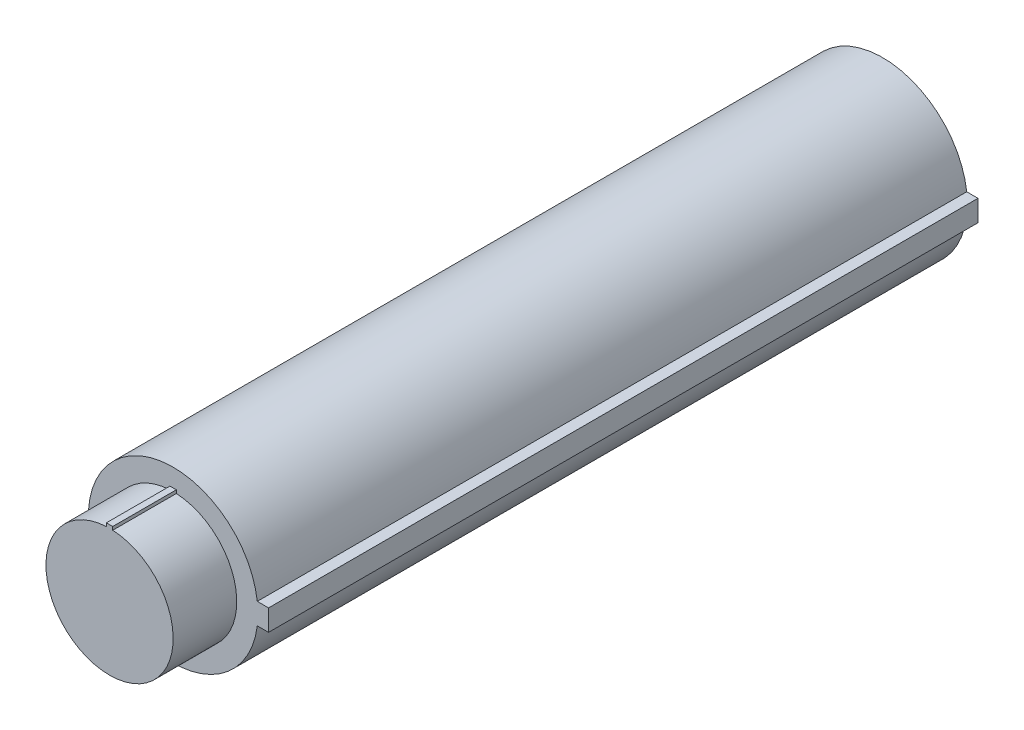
ISO-10303-21;
HEADER;
FILE_DESCRIPTION(('STEP AP214'),'2;1');
FILE_NAME('part.step','',(''),(''),'','','');
FILE_SCHEMA(('AUTOMOTIVE_DESIGN { 1 0 10303 214 1 1 1 1 }'));
ENDSEC;
DATA;
#1=APPLICATION_CONTEXT('core data for automotive mechanical design processes');
#2=APPLICATION_PROTOCOL_DEFINITION('international standard','automotive_design',2000,#1);
#3=PRODUCT_CONTEXT('',#1,'mechanical');
#4=PRODUCT('Part','Part','',(#3));
#5=PRODUCT_RELATED_PRODUCT_CATEGORY('part','',(#4));
#6=PRODUCT_DEFINITION_FORMATION('','',#4);
#7=PRODUCT_DEFINITION_CONTEXT('part definition',#1,'design');
#8=PRODUCT_DEFINITION('design','',#6,#7);
#9=PRODUCT_DEFINITION_SHAPE('','',#8);
#10=(LENGTH_UNIT() NAMED_UNIT(*) SI_UNIT(.MILLI.,.METRE.));
#11=(NAMED_UNIT(*) PLANE_ANGLE_UNIT() SI_UNIT($,.RADIAN.));
#12=(NAMED_UNIT(*) SI_UNIT($,.STERADIAN.) SOLID_ANGLE_UNIT());
#13=UNCERTAINTY_MEASURE_WITH_UNIT(LENGTH_MEASURE(1.E-05),#10,'distance_accuracy_value','');
#14=(GEOMETRIC_REPRESENTATION_CONTEXT(3) GLOBAL_UNCERTAINTY_ASSIGNED_CONTEXT((#13)) GLOBAL_UNIT_ASSIGNED_CONTEXT((#10,
#11,#12)) REPRESENTATION_CONTEXT('',''));
#15=CARTESIAN_POINT('',(0.,0.,0.));
#16=DIRECTION('',(0.,0.,1.));
#17=DIRECTION('',(1.,0.,0.));
#18=AXIS2_PLACEMENT_3D('',#15,#16,#17);
#19=CARTESIAN_POINT('',(0.,0.,0.));
#20=DIRECTION('',(0.,0.,-1.));
#21=DIRECTION('',(-1.,0.,0.));
#22=AXIS2_PLACEMENT_3D('',#19,#20,#21);
#23=PLANE('',#22);
#24=DIRECTION('',(0.,-1.,0.));
#25=VECTOR('',#24,1.);
#26=CARTESIAN_POINT('',(-0.750000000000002,15.75,0.));
#27=LINE('',#26,#25);
#28=CARTESIAN_POINT('',(-0.750000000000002,15.75,0.));
#29=VERTEX_POINT('',#28);
#30=CARTESIAN_POINT('',(-0.750000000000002,14.9812382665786,0.));
#31=VERTEX_POINT('',#30);
#32=EDGE_CURVE('E133',#29,#31,#27,.T.);
#33=ORIENTED_EDGE('',*,*,#32,.T.);
#34=CARTESIAN_POINT('',(0.,0.,0.));
#35=DIRECTION('',(0.,0.,1.));
#36=DIRECTION('',(1.,0.,0.));
#37=AXIS2_PLACEMENT_3D('',#34,#35,#36);
#38=CIRCLE('',#37,15.);
#39=CARTESIAN_POINT('',(0.749999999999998,14.9812382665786,0.));
#40=VERTEX_POINT('',#39);
#41=EDGE_CURVE('E40',#31,#40,#38,.T.);
#42=ORIENTED_EDGE('',*,*,#41,.T.);
#43=DIRECTION('',(0.,1.,0.));
#44=VECTOR('',#43,1.);
#45=CARTESIAN_POINT('',(0.749999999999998,15.75,0.));
#46=LINE('',#45,#44);
#47=CARTESIAN_POINT('',(0.749999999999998,15.75,0.));
#48=VERTEX_POINT('',#47);
#49=EDGE_CURVE('E132',#40,#48,#46,.T.);
#50=ORIENTED_EDGE('',*,*,#49,.T.);
#51=DIRECTION('',(-1.,0.,0.));
#52=VECTOR('',#51,1.);
#53=CARTESIAN_POINT('',(-0.750000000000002,15.75,0.));
#54=LINE('',#53,#52);
#55=EDGE_CURVE('E137',#48,#29,#54,.T.);
#56=ORIENTED_EDGE('',*,*,#55,.T.);
#57=EDGE_LOOP('',(#33,#42,#50,#56));
#58=FACE_BOUND('',#57,.T.);
#59=ADVANCED_FACE('F33',(#58),#23,.F.);
#60=CARTESIAN_POINT('',(0.,0.,0.));
#61=DIRECTION('',(0.,0.,1.));
#62=DIRECTION('',(1.,0.,0.));
#63=AXIS2_PLACEMENT_3D('',#60,#61,#62);
#64=CYLINDRICAL_SURFACE('',#63,15.);
#65=ORIENTED_EDGE('',*,*,#41,.F.);
#66=DIRECTION('',(0.,0.,1.));
#67=VECTOR('',#66,1.);
#68=CARTESIAN_POINT('',(-0.750000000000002,14.9812382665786,0.));
#69=LINE('',#68,#67);
#70=CARTESIAN_POINT('',(-0.750000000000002,14.9812382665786,-15.));
#71=VERTEX_POINT('',#70);
#72=EDGE_CURVE('E151',#31,#71,#69,.F.);
#73=ORIENTED_EDGE('',*,*,#72,.T.);
#74=CARTESIAN_POINT('',(0.,0.,-15.));
#75=DIRECTION('',(0.,0.,1.));
#76=DIRECTION('',(1.,0.,0.));
#77=AXIS2_PLACEMENT_3D('',#74,#75,#76);
#78=CIRCLE('',#77,15.);
#79=CARTESIAN_POINT('',(0.749999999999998,14.9812382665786,-15.));
#80=VERTEX_POINT('',#79);
#81=EDGE_CURVE('E157',#71,#80,#78,.T.);
#82=ORIENTED_EDGE('',*,*,#81,.T.);
#83=DIRECTION('',(0.,0.,1.));
#84=VECTOR('',#83,1.);
#85=CARTESIAN_POINT('',(0.749999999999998,14.9812382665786,0.));
#86=LINE('',#85,#84);
#87=EDGE_CURVE('E55',#80,#40,#86,.T.);
#88=ORIENTED_EDGE('',*,*,#87,.T.);
#89=EDGE_LOOP('',(#65,#73,#82,#88));
#90=FACE_BOUND('',#89,.T.);
#91=ADVANCED_FACE('F164',(#90),#64,.T.);
#92=CARTESIAN_POINT('',(0.,15.,-15.));
#93=DIRECTION('',(0.,0.,-1.));
#94=DIRECTION('',(-1.,0.,0.));
#95=AXIS2_PLACEMENT_3D('',#92,#93,#94);
#96=PLANE('',#95);
#97=ORIENTED_EDGE('',*,*,#81,.F.);
#98=DIRECTION('',(0.,-1.,0.));
#99=VECTOR('',#98,1.);
#100=CARTESIAN_POINT('',(-0.750000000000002,15.75,-15.));
#101=LINE('',#100,#99);
#102=CARTESIAN_POINT('',(-0.750000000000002,15.75,-15.));
#103=VERTEX_POINT('',#102);
#104=EDGE_CURVE('E144',#103,#71,#101,.T.);
#105=ORIENTED_EDGE('',*,*,#104,.F.);
#106=DIRECTION('',(-1.,0.,0.));
#107=VECTOR('',#106,1.);
#108=CARTESIAN_POINT('',(-0.750000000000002,15.75,-15.));
#109=LINE('',#108,#107);
#110=CARTESIAN_POINT('',(0.749999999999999,15.75,-15.));
#111=VERTEX_POINT('',#110);
#112=EDGE_CURVE('E136',#111,#103,#109,.T.);
#113=ORIENTED_EDGE('',*,*,#112,.F.);
#114=DIRECTION('',(0.,-1.,0.));
#115=VECTOR('',#114,1.);
#116=CARTESIAN_POINT('',(0.749999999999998,15.,-15.));
#117=LINE('',#116,#115);
#118=EDGE_CURVE('E11',#111,#80,#117,.T.);
#119=ORIENTED_EDGE('',*,*,#118,.T.);
#120=EDGE_LOOP('',(#97,#105,#113,#119));
#121=FACE_BOUND('',#120,.T.);
#122=CARTESIAN_POINT('',(0.,0.,-15.));
#123=DIRECTION('',(0.,0.,1.));
#124=DIRECTION('',(1.,0.,0.));
#125=AXIS2_PLACEMENT_3D('',#122,#123,#124);
#126=CIRCLE('',#125,20.);
#127=CARTESIAN_POINT('',(19.8431348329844,2.5,-15.));
#128=VERTEX_POINT('',#127);
#129=CARTESIAN_POINT('',(19.8431348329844,-2.5,-15.));
#130=VERTEX_POINT('',#129);
#131=EDGE_CURVE('E155',#128,#130,#126,.T.);
#132=ORIENTED_EDGE('',*,*,#131,.T.);
#133=DIRECTION('',(1.,0.,0.));
#134=VECTOR('',#133,1.);
#135=CARTESIAN_POINT('',(22.5,-2.5,-15.));
#136=LINE('',#135,#134);
#137=CARTESIAN_POINT('',(22.5,-2.5,-15.));
#138=VERTEX_POINT('',#137);
#139=EDGE_CURVE('E127',#130,#138,#136,.T.);
#140=ORIENTED_EDGE('',*,*,#139,.T.);
#141=DIRECTION('',(0.,1.,0.));
#142=VECTOR('',#141,1.);
#143=CARTESIAN_POINT('',(22.5,-2.5,-15.));
#144=LINE('',#143,#142);
#145=CARTESIAN_POINT('',(22.5,2.5,-15.));
#146=VERTEX_POINT('',#145);
#147=EDGE_CURVE('E123',#138,#146,#144,.T.);
#148=ORIENTED_EDGE('',*,*,#147,.T.);
#149=DIRECTION('',(-1.,0.,0.));
#150=VECTOR('',#149,1.);
#151=CARTESIAN_POINT('',(22.5,2.5,-15.));
#152=LINE('',#151,#150);
#153=EDGE_CURVE('E47',#146,#128,#152,.T.);
#154=ORIENTED_EDGE('',*,*,#153,.T.);
#155=EDGE_LOOP('',(#132,#140,#148,#154));
#156=FACE_BOUND('',#155,.T.);
#157=ADVANCED_FACE('F168',(#121,#156),#96,.F.);
#158=CARTESIAN_POINT('',(0.,0.,0.));
#159=DIRECTION('',(0.,0.,1.));
#160=DIRECTION('',(1.,0.,0.));
#161=AXIS2_PLACEMENT_3D('',#158,#159,#160);
#162=CYLINDRICAL_SURFACE('',#161,20.);
#163=CARTESIAN_POINT('',(0.,0.,-182.32));
#164=DIRECTION('',(0.,0.,1.));
#165=DIRECTION('',(1.,0.,0.));
#166=AXIS2_PLACEMENT_3D('',#163,#164,#165);
#167=CIRCLE('',#166,20.);
#168=CARTESIAN_POINT('',(19.8431348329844,2.5,-182.32));
#169=VERTEX_POINT('',#168);
#170=CARTESIAN_POINT('',(19.8431348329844,-2.5,-182.32));
#171=VERTEX_POINT('',#170);
#172=EDGE_CURVE('E105',#169,#171,#167,.T.);
#173=ORIENTED_EDGE('',*,*,#172,.T.);
#174=DIRECTION('',(0.,0.,1.));
#175=VECTOR('',#174,1.);
#176=CARTESIAN_POINT('',(19.8431348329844,-2.5,0.));
#177=LINE('',#176,#175);
#178=EDGE_CURVE('E129',#171,#130,#177,.T.);
#179=ORIENTED_EDGE('',*,*,#178,.T.);
#180=ORIENTED_EDGE('',*,*,#131,.F.);
#181=DIRECTION('',(0.,0.,1.));
#182=VECTOR('',#181,1.);
#183=CARTESIAN_POINT('',(19.8431348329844,2.5,0.));
#184=LINE('',#183,#182);
#185=EDGE_CURVE('E126',#128,#169,#184,.F.);
#186=ORIENTED_EDGE('',*,*,#185,.T.);
#187=EDGE_LOOP('',(#173,#179,#180,#186));
#188=FACE_BOUND('',#187,.T.);
#189=ADVANCED_FACE('F184',(#188),#162,.T.);
#190=CARTESIAN_POINT('',(0.,20.,-182.32));
#191=DIRECTION('',(0.,0.,1.));
#192=DIRECTION('',(1.,0.,0.));
#193=AXIS2_PLACEMENT_3D('',#190,#191,#192);
#194=PLANE('',#193);
#195=ORIENTED_EDGE('',*,*,#172,.F.);
#196=DIRECTION('',(1.,0.,0.));
#197=VECTOR('',#196,1.);
#198=CARTESIAN_POINT('',(22.5,2.5,-182.32));
#199=LINE('',#198,#197);
#200=CARTESIAN_POINT('',(22.5,2.5,-182.32));
#201=VERTEX_POINT('',#200);
#202=EDGE_CURVE('E97',#169,#201,#199,.T.);
#203=ORIENTED_EDGE('',*,*,#202,.T.);
#204=DIRECTION('',(0.,-1.,0.));
#205=VECTOR('',#204,1.);
#206=CARTESIAN_POINT('',(22.5,-2.5,-182.32));
#207=LINE('',#206,#205);
#208=CARTESIAN_POINT('',(22.5,-2.5,-182.32));
#209=VERTEX_POINT('',#208);
#210=EDGE_CURVE('E102',#201,#209,#207,.T.);
#211=ORIENTED_EDGE('',*,*,#210,.T.);
#212=DIRECTION('',(-1.,0.,0.));
#213=VECTOR('',#212,1.);
#214=CARTESIAN_POINT('',(22.5,-2.5,-182.32));
#215=LINE('',#214,#213);
#216=EDGE_CURVE('E115',#209,#171,#215,.T.);
#217=ORIENTED_EDGE('',*,*,#216,.T.);
#218=EDGE_LOOP('',(#195,#203,#211,#217));
#219=FACE_BOUND('',#218,.T.);
#220=ADVANCED_FACE('F99',(#219),#194,.F.);
#221=CARTESIAN_POINT('',(-0.750000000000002,15.75,-17.1213203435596));
#222=DIRECTION('',(-1.,0.,0.));
#223=DIRECTION('',(0.,0.,1.));
#224=AXIS2_PLACEMENT_3D('',#221,#222,#223);
#225=PLANE('',#224);
#226=ORIENTED_EDGE('',*,*,#72,.F.);
#227=ORIENTED_EDGE('',*,*,#32,.F.);
#228=DIRECTION('',(0.,0.,1.));
#229=VECTOR('',#228,1.);
#230=CARTESIAN_POINT('',(-0.750000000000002,15.75,-17.1213203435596));
#231=LINE('',#230,#229);
#232=EDGE_CURVE('E143',#103,#29,#231,.T.);
#233=ORIENTED_EDGE('',*,*,#232,.F.);
#234=ORIENTED_EDGE('',*,*,#104,.T.);
#235=EDGE_LOOP('',(#226,#227,#233,#234));
#236=FACE_BOUND('',#235,.T.);
#237=ADVANCED_FACE('F176',(#236),#225,.T.);
#238=CARTESIAN_POINT('',(0.749999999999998,15.75,-17.1213203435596));
#239=DIRECTION('',(1.,0.,0.));
#240=DIRECTION('',(0.,1.,0.));
#241=AXIS2_PLACEMENT_3D('',#238,#239,#240);
#242=PLANE('',#241);
#243=ORIENTED_EDGE('',*,*,#87,.F.);
#244=ORIENTED_EDGE('',*,*,#118,.F.);
#245=DIRECTION('',(0.,0.,1.));
#246=VECTOR('',#245,1.);
#247=CARTESIAN_POINT('',(0.749999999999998,15.75,-17.1213203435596));
#248=LINE('',#247,#246);
#249=EDGE_CURVE('E146',#111,#48,#248,.T.);
#250=ORIENTED_EDGE('',*,*,#249,.T.);
#251=ORIENTED_EDGE('',*,*,#49,.F.);
#252=EDGE_LOOP('',(#243,#244,#250,#251));
#253=FACE_BOUND('',#252,.T.);
#254=ADVANCED_FACE('F171',(#253),#242,.T.);
#255=CARTESIAN_POINT('',(-0.750000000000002,15.75,-17.1213203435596));
#256=DIRECTION('',(0.,1.,0.));
#257=DIRECTION('',(0.,0.,1.));
#258=AXIS2_PLACEMENT_3D('',#255,#256,#257);
#259=PLANE('',#258);
#260=ORIENTED_EDGE('',*,*,#249,.F.);
#261=ORIENTED_EDGE('',*,*,#112,.T.);
#262=ORIENTED_EDGE('',*,*,#232,.T.);
#263=ORIENTED_EDGE('',*,*,#55,.F.);
#264=EDGE_LOOP('',(#260,#261,#262,#263));
#265=FACE_BOUND('',#264,.T.);
#266=ADVANCED_FACE('F174',(#265),#259,.T.);
#267=CARTESIAN_POINT('',(22.5,-2.5,-7.92893218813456));
#268=DIRECTION('',(0.,-1.,0.));
#269=DIRECTION('',(0.,0.,-1.));
#270=AXIS2_PLACEMENT_3D('',#267,#268,#269);
#271=PLANE('',#270);
#272=ORIENTED_EDGE('',*,*,#178,.F.);
#273=ORIENTED_EDGE('',*,*,#216,.F.);
#274=DIRECTION('',(0.,0.,-1.));
#275=VECTOR('',#274,1.);
#276=CARTESIAN_POINT('',(22.5,-2.5,-7.92893218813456));
#277=LINE('',#276,#275);
#278=EDGE_CURVE('E114',#138,#209,#277,.T.);
#279=ORIENTED_EDGE('',*,*,#278,.F.);
#280=ORIENTED_EDGE('',*,*,#139,.F.);
#281=EDGE_LOOP('',(#272,#273,#279,#280));
#282=FACE_BOUND('',#281,.T.);
#283=ADVANCED_FACE('F199',(#282),#271,.T.);
#284=CARTESIAN_POINT('',(22.5,2.5,-7.92893218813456));
#285=DIRECTION('',(0.,1.,0.));
#286=DIRECTION('',(0.,0.,1.));
#287=AXIS2_PLACEMENT_3D('',#284,#285,#286);
#288=PLANE('',#287);
#289=ORIENTED_EDGE('',*,*,#185,.F.);
#290=ORIENTED_EDGE('',*,*,#153,.F.);
#291=DIRECTION('',(0.,0.,-1.));
#292=VECTOR('',#291,1.);
#293=CARTESIAN_POINT('',(22.5,2.5,-7.92893218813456));
#294=LINE('',#293,#292);
#295=EDGE_CURVE('E110',#146,#201,#294,.T.);
#296=ORIENTED_EDGE('',*,*,#295,.T.);
#297=ORIENTED_EDGE('',*,*,#202,.F.);
#298=EDGE_LOOP('',(#289,#290,#296,#297));
#299=FACE_BOUND('',#298,.T.);
#300=ADVANCED_FACE('F111',(#299),#288,.T.);
#301=CARTESIAN_POINT('',(22.5,-2.5,-7.92893218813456));
#302=DIRECTION('',(1.,0.,0.));
#303=DIRECTION('',(0.,0.,-1.));
#304=AXIS2_PLACEMENT_3D('',#301,#302,#303);
#305=PLANE('',#304);
#306=ORIENTED_EDGE('',*,*,#147,.F.);
#307=ORIENTED_EDGE('',*,*,#278,.T.);
#308=ORIENTED_EDGE('',*,*,#210,.F.);
#309=ORIENTED_EDGE('',*,*,#295,.F.);
#310=EDGE_LOOP('',(#306,#307,#308,#309));
#311=FACE_BOUND('',#310,.T.);
#312=ADVANCED_FACE('F117',(#311),#305,.T.);
#313=CLOSED_SHELL('',(#59,#91,#157,#189,#220,#237,#254,#266,#283,#300,#312));
#314=MANIFOLD_SOLID_BREP('B2',#313);
#315=ADVANCED_BREP_SHAPE_REPRESENTATION('',(#18,#314),#14);
#316=SHAPE_DEFINITION_REPRESENTATION(#9,#315);
ENDSEC;
END-ISO-10303-21;
